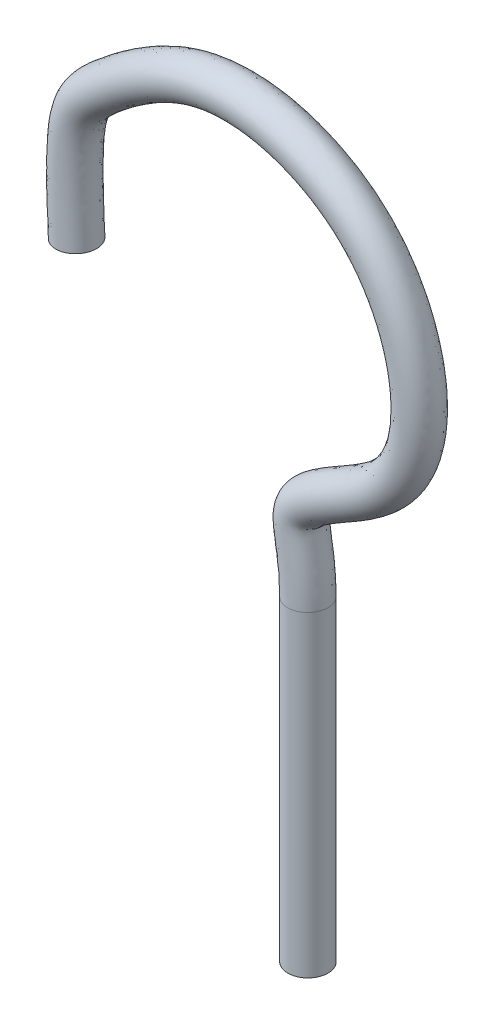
ISO-10303-21;
HEADER;
FILE_DESCRIPTION(('STEP AP214'),'2;1');
FILE_NAME('part.step','',(''),(''),'','','');
FILE_SCHEMA(('AUTOMOTIVE_DESIGN { 1 0 10303 214 1 1 1 1 }'));
ENDSEC;
DATA;
#1=APPLICATION_CONTEXT('core data for automotive mechanical design processes');
#2=APPLICATION_PROTOCOL_DEFINITION('international standard','automotive_design',2000,#1);
#3=PRODUCT_CONTEXT('',#1,'mechanical');
#4=PRODUCT('Part','Part','',(#3));
#5=PRODUCT_RELATED_PRODUCT_CATEGORY('part','',(#4));
#6=PRODUCT_DEFINITION_FORMATION('','',#4);
#7=PRODUCT_DEFINITION_CONTEXT('part definition',#1,'design');
#8=PRODUCT_DEFINITION('design','',#6,#7);
#9=PRODUCT_DEFINITION_SHAPE('','',#8);
#10=(LENGTH_UNIT() NAMED_UNIT(*) SI_UNIT(.MILLI.,.METRE.));
#11=(NAMED_UNIT(*) PLANE_ANGLE_UNIT() SI_UNIT($,.RADIAN.));
#12=(NAMED_UNIT(*) SI_UNIT($,.STERADIAN.) SOLID_ANGLE_UNIT());
#13=UNCERTAINTY_MEASURE_WITH_UNIT(LENGTH_MEASURE(1.E-05),#10,'distance_accuracy_value','');
#14=(GEOMETRIC_REPRESENTATION_CONTEXT(3) GLOBAL_UNCERTAINTY_ASSIGNED_CONTEXT((#13)) GLOBAL_UNIT_ASSIGNED_CONTEXT((#10,
#11,#12)) REPRESENTATION_CONTEXT('',''));
#15=CARTESIAN_POINT('',(0.,0.,0.));
#16=DIRECTION('',(0.,0.,1.));
#17=DIRECTION('',(1.,0.,0.));
#18=AXIS2_PLACEMENT_3D('',#15,#16,#17);
#19=CARTESIAN_POINT('',(0.,59.192237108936,0.));
#20=DIRECTION('',(0.,-1.,0.));
#21=DIRECTION('',(0.,0.,-1.));
#22=AXIS2_PLACEMENT_3D('',#19,#20,#21);
#23=CYLINDRICAL_SURFACE('',#22,3.175);
#24=CARTESIAN_POINT('',(0.,0.,0.));
#25=DIRECTION('',(0.,1.,0.));
#26=DIRECTION('',(0.,0.,1.));
#27=AXIS2_PLACEMENT_3D('',#24,#25,#26);
#28=CIRCLE('',#27,3.175);
#29=CARTESIAN_POINT('',(0.,0.,3.175));
#30=VERTEX_POINT('',#29);
#31=EDGE_CURVE('E36',#30,#30,#28,.T.);
#32=ORIENTED_EDGE('',*,*,#31,.T.);
#33=EDGE_LOOP('',(#32));
#34=FACE_BOUND('',#33,.T.);
#35=CARTESIAN_POINT('',(0.,50.2119809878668,0.));
#36=DIRECTION('',(-0.00847366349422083,0.999964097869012,0.));
#37=DIRECTION('',(-0.999964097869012,-0.00847366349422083,0.));
#38=AXIS2_PLACEMENT_3D('',#35,#36,#37);
#39=ELLIPSE('',#38,3.17511399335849,3.175);
#40=CARTESIAN_POINT('',(-3.175,50.1850761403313,0.));
#41=VERTEX_POINT('',#40);
#42=EDGE_CURVE('E10',#41,#41,#39,.T.);
#43=ORIENTED_EDGE('',*,*,#42,.F.);
#44=EDGE_LOOP('',(#43));
#45=FACE_BOUND('',#44,.T.);
#46=ADVANCED_FACE('F30',(#34,#45),#23,.T.);
#47=CARTESIAN_POINT('',(0.,0.,0.));
#48=DIRECTION('',(0.,1.,0.));
#49=DIRECTION('',(0.,0.,1.));
#50=AXIS2_PLACEMENT_3D('',#47,#48,#49);
#51=PLANE('',#50);
#52=ORIENTED_EDGE('',*,*,#31,.F.);
#53=EDGE_LOOP('',(#52));
#54=FACE_BOUND('',#53,.T.);
#55=ADVANCED_FACE('F51',(#54),#51,.F.);
#56=CARTESIAN_POINT('',(-39.877412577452,80.960911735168,0.));
#57=DIRECTION('',(-0.042817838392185,0.99908289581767,0.));
#58=DIRECTION('',(-0.99908289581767,-0.042817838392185,0.));
#59=AXIS2_PLACEMENT_3D('',#56,#57,#58);
#60=PLANE('',#59);
#61=CARTESIAN_POINT('',(-36.7053243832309,81.0968583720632,0.));
#62=DIRECTION('',(-0.0428178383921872,0.99908289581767,0.));
#63=DIRECTION('',(-0.99908289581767,-0.0428178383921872,0.));
#64=AXIS2_PLACEMENT_3D('',#61,#62,#63);
#65=CIRCLE('',#64,3.175);
#66=CARTESIAN_POINT('',(-39.877412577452,80.960911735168,0.));
#67=VERTEX_POINT('',#66);
#68=EDGE_CURVE('E40',#67,#67,#65,.T.);
#69=ORIENTED_EDGE('',*,*,#68,.F.);
#70=EDGE_LOOP('',(#69));
#71=FACE_BOUND('',#70,.T.);
#72=ADVANCED_FACE('F49',(#71),#60,.F.);
#73=CARTESIAN_POINT('',(-3.175,50.1850761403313,0.));
#74=CARTESIAN_POINT('',(-3.20229967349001,51.7957568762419,0.));
#75=CARTESIAN_POINT('',(-3.36604557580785,54.1860246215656,0.));
#76=CARTESIAN_POINT('',(-3.8522734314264,57.1630722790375,0.));
#77=CARTESIAN_POINT('',(-4.16279569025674,59.2565556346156,0.));
#78=CARTESIAN_POINT('',(-4.26476438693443,60.7847362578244,0.));
#79=CARTESIAN_POINT('',(-4.05722312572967,62.5607796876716,0.));
#80=CARTESIAN_POINT('',(-3.16658085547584,64.5408891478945,0.));
#81=CARTESIAN_POINT('',(-1.76440722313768,66.0497804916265,0.));
#82=CARTESIAN_POINT('',(-0.193154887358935,67.2680376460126,0.));
#83=CARTESIAN_POINT('',(2.40900807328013,68.9264801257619,0.));
#84=CARTESIAN_POINT('',(5.71371886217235,70.733372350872,0.));
#85=CARTESIAN_POINT('',(9.35596401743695,73.0748949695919,0.));
#86=CARTESIAN_POINT('',(11.9960999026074,75.6968502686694,0.));
#87=CARTESIAN_POINT('',(13.7601149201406,79.1175865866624,0.));
#88=CARTESIAN_POINT('',(14.5798968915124,83.1893012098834,0.));
#89=CARTESIAN_POINT('',(14.4649643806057,87.5771636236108,0.));
#90=CARTESIAN_POINT('',(13.4067611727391,92.4988409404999,0.));
#91=CARTESIAN_POINT('',(11.2516204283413,97.5730914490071,0.));
#92=CARTESIAN_POINT('',(7.88543030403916,102.223247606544,0.));
#93=CARTESIAN_POINT('',(3.64848366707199,105.856140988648,0.));
#94=CARTESIAN_POINT('',(-1.30240845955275,108.512170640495,0.));
#95=CARTESIAN_POINT('',(-6.70536320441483,110.130810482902,0.));
#96=CARTESIAN_POINT('',(-12.3541278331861,110.515226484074,0.));
#97=CARTESIAN_POINT('',(-17.914476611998,109.486161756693,0.));
#98=CARTESIAN_POINT('',(-22.6214209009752,107.199144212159,0.));
#99=CARTESIAN_POINT('',(-26.4620242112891,104.67689008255,0.));
#100=CARTESIAN_POINT('',(-29.2291829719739,102.513838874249,0.));
#101=CARTESIAN_POINT('',(-31.5215871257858,100.520802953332,0.));
#102=CARTESIAN_POINT('',(-32.5653368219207,99.2331157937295,0.));
#103=CARTESIAN_POINT('',(-33.0760074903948,98.121928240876,0.));
#104=CARTESIAN_POINT('',(-33.4180272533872,96.8790226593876,0.));
#105=CARTESIAN_POINT('',(-33.6640630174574,95.138062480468,0.));
#106=CARTESIAN_POINT('',(-33.9466008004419,90.0346229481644,0.));
#107=CARTESIAN_POINT('',(-33.7044362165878,85.2274723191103,0.));
#108=CARTESIAN_POINT('',(-33.5332361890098,81.2328050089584,0.));
#109=CARTESIAN_POINT('',(-3.175,50.1850761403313,6.34999999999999));
#110=CARTESIAN_POINT('',(-3.2083257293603,52.151294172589,6.34999999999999));
#111=CARTESIAN_POINT('',(-3.3640083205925,54.0658265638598,6.35));
#112=CARTESIAN_POINT('',(-3.8524357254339,57.17264762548,6.34999999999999));
#113=CARTESIAN_POINT('',(-4.16277337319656,59.2552389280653,6.35));
#114=CARTESIAN_POINT('',(-4.26476953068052,60.7850397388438,6.34999999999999));
#115=CARTESIAN_POINT('',(-4.05722180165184,62.5607015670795,6.34999999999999));
#116=CARTESIAN_POINT('',(-3.16658135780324,64.5409187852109,6.35));
#117=CARTESIAN_POINT('',(-1.76440704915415,66.0497702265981,6.35));
#118=CARTESIAN_POINT('',(-0.193154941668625,67.2680408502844,6.34999999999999));
#119=CARTESIAN_POINT('',(2.40900811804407,68.92647748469,6.35));
#120=CARTESIAN_POINT('',(5.71371884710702,70.7333732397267,6.34999999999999));
#121=CARTESIAN_POINT('',(9.35596402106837,73.0748947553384,6.34999999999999));
#122=CARTESIAN_POINT('',(11.996099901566,75.6968503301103,6.34999999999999));
#123=CARTESIAN_POINT('',(13.7601149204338,79.1175865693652,6.34999999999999));
#124=CARTESIAN_POINT('',(14.5798968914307,83.1893012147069,6.34999999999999));
#125=CARTESIAN_POINT('',(14.464964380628,87.5771636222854,6.35));
#126=CARTESIAN_POINT('',(13.4067611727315,92.4988409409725,6.34999999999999));
#127=CARTESIAN_POINT('',(11.2516204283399,97.5730914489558,6.35));
#128=CARTESIAN_POINT('',(7.88543030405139,102.223247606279,6.34999999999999));
#129=CARTESIAN_POINT('',(3.64848366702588,105.856140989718,6.35));
#130=CARTESIAN_POINT('',(-1.30240845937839,108.512170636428,6.34999999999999));
#131=CARTESIAN_POINT('',(-6.70536320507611,110.130810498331,6.34999999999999));
#132=CARTESIAN_POINT('',(-12.3541278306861,110.51522642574,6.34999999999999));
#133=CARTESIAN_POINT('',(-17.9144766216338,109.486161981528,6.34999999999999));
#134=CARTESIAN_POINT('',(-22.6214208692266,107.199143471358,6.35));
#135=CARTESIAN_POINT('',(-26.4620242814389,104.676891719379,6.34999999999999));
#136=CARTESIAN_POINT('',(-29.2291827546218,102.513833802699,6.35));
#137=CARTESIAN_POINT('',(-31.5215877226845,100.520816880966,6.35));
#138=CARTESIAN_POINT('',(-32.5653353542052,99.2330815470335,6.34999999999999));
#139=CARTESIAN_POINT('',(-33.0760105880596,98.1220005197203,6.35));
#140=CARTESIAN_POINT('',(-33.4180122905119,96.8786735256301,6.34999999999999));
#141=CARTESIAN_POINT('',(-33.6641390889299,95.1398374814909,6.34999999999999));
#142=CARTESIAN_POINT('',(-33.9456472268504,90.0123728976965,6.34999999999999));
#143=CARTESIAN_POINT('',(-33.7148699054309,85.4709250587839,6.34999999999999));
#144=CARTESIAN_POINT('',(-33.5332361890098,81.2328050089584,6.34999999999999));
#145=CARTESIAN_POINT('',(3.175,50.2388858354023,6.34999999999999));
#146=CARTESIAN_POINT('',(3.1416742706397,52.20510386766,6.34999999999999));
#147=CARTESIAN_POINT('',(2.95628712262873,54.8517315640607,6.35));
#148=CARTESIAN_POINT('',(2.39498514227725,58.3103866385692,6.34999999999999));
#149=CARTESIAN_POINT('',(2.14670933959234,60.0133096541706,6.35));
#150=CARTESIAN_POINT('',(2.12006660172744,60.7183182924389,6.34999999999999));
#151=CARTESIAN_POINT('',(2.17157502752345,60.8966335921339,6.34999999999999));
#152=CARTESIAN_POINT('',(2.13218938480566,60.8387799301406,6.35));
#153=CARTESIAN_POINT('',(2.45846467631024,61.2755236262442,6.35));
#154=CARTESIAN_POINT('',(3.41730241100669,62.0346407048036,6.34999999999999));
#155=CARTESIAN_POINT('',(5.50199149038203,63.3719681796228,6.35));
#156=CARTESIAN_POINT('',(8.86719175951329,65.2324637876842,6.34999999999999));
#157=CARTESIAN_POINT('',(13.1337976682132,67.9003023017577,6.34999999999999));
#158=CARTESIAN_POINT('',(17.2465881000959,71.9237867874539,6.34999999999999));
#159=CARTESIAN_POINT('',(19.8544375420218,77.0673093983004,6.34999999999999));
#160=CARTESIAN_POINT('',(20.9649217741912,82.7142399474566,6.34999999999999));
#161=CARTESIAN_POINT('',(20.7998647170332,88.3775781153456,6.35));
#162=CARTESIAN_POINT('',(19.4806463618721,94.4737741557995,6.34999999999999));
#163=CARTESIAN_POINT('',(16.8564661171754,100.66926473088,6.35));
#164=CARTESIAN_POINT('',(12.603802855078,106.56548782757,6.34999999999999));
#165=CARTESIAN_POINT('',(7.2317553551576,111.156900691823,6.35));
#166=CARTESIAN_POINT('',(1.14785494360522,114.41711276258,6.34999999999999));
#167=CARTESIAN_POINT('',(-5.53835888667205,116.42180926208,6.34999999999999));
#168=CARTESIAN_POINT('',(-12.6666265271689,116.933434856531,6.34999999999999));
#169=CARTESIAN_POINT('',(-20.0253228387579,115.556150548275,6.34999999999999));
#170=CARTESIAN_POINT('',(-25.7952234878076,112.714705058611,6.35));
#171=CARTESIAN_POINT('',(-30.164091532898,109.8506287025,6.34999999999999));
#172=CARTESIAN_POINT('',(-33.2958853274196,107.37619920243,6.35));
#173=CARTESIAN_POINT('',(-35.810237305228,105.259321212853,6.35));
#174=CARTESIAN_POINT('',(-37.9701170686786,102.708626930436,6.34999999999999));
#175=CARTESIAN_POINT('',(-39.1071133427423,100.208395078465,6.35));
#176=CARTESIAN_POINT('',(-39.6729517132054,98.0561948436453,6.34999999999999));
#177=CARTESIAN_POINT('',(-39.9969857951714,95.6874253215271,6.34999999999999));
#178=CARTESIAN_POINT('',(-40.314456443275,89.7179299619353,6.34999999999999));
#179=CARTESIAN_POINT('',(-40.0590462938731,85.1990317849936,6.34999999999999));
#180=CARTESIAN_POINT('',(-39.877412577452,80.960911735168,6.34999999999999));
#181=CARTESIAN_POINT('',(3.175,50.2388858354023,0.));
#182=CARTESIAN_POINT('',(3.14468729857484,52.0273352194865,0.));
#183=CARTESIAN_POINT('',(2.95526849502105,54.9118305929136,0.));
#184=CARTESIAN_POINT('',(2.395066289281,58.3055989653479,0.));
#185=CARTESIAN_POINT('',(2.14669818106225,60.0139680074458,0.));
#186=CARTESIAN_POINT('',(2.12006917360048,60.7181665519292,0.));
#187=CARTESIAN_POINT('',(2.17157436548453,60.8966726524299,0.));
#188=CARTESIAN_POINT('',(2.13218963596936,60.8387651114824,0.));
#189=CARTESIAN_POINT('',(2.45846458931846,61.2755287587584,0.));
#190=CARTESIAN_POINT('',(3.41730243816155,62.0346391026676,0.));
#191=CARTESIAN_POINT('',(5.50199146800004,63.3719695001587,0.));
#192=CARTESIAN_POINT('',(8.86719176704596,65.2324633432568,0.));
#193=CARTESIAN_POINT('',(13.1337976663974,67.9003024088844,0.));
#194=CARTESIAN_POINT('',(17.2465881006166,71.9237867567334,0.));
#195=CARTESIAN_POINT('',(19.8544375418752,77.067309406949,0.));
#196=CARTESIAN_POINT('',(20.9649217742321,82.7142399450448,0.));
#197=CARTESIAN_POINT('',(20.799864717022,88.3775781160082,0.));
#198=CARTESIAN_POINT('',(19.4806463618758,94.4737741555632,0.));
#199=CARTESIAN_POINT('',(16.8564661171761,100.669264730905,0.));
#200=CARTESIAN_POINT('',(12.6038028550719,106.565487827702,0.));
#201=CARTESIAN_POINT('',(7.23175535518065,111.156900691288,0.));
#202=CARTESIAN_POINT('',(1.14785494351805,114.417112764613,0.));
#203=CARTESIAN_POINT('',(-5.5383588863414,116.421809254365,0.));
#204=CARTESIAN_POINT('',(-12.6666265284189,116.933434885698,0.));
#205=CARTESIAN_POINT('',(-20.02532283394,115.556150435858,0.));
#206=CARTESIAN_POINT('',(-25.7952235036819,112.714705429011,0.));
#207=CARTESIAN_POINT('',(-30.164091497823,109.850627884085,0.));
#208=CARTESIAN_POINT('',(-33.2958854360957,107.376201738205,0.));
#209=CARTESIAN_POINT('',(-35.8102370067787,105.259314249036,0.));
#210=CARTESIAN_POINT('',(-37.9701178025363,102.708644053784,0.));
#211=CARTESIAN_POINT('',(-39.10711179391,100.208358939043,0.));
#212=CARTESIAN_POINT('',(-39.6729591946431,98.056369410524,0.));
#213=CARTESIAN_POINT('',(-39.9969477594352,95.6865378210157,0.));
#214=CARTESIAN_POINT('',(-40.3149332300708,89.7290549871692,0.));
#215=CARTESIAN_POINT('',(-40.0538294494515,85.0773054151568,0.));
#216=CARTESIAN_POINT('',(-39.877412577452,80.960911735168,0.));
#217=CARTESIAN_POINT('',(3.175,50.2388858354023,-6.34999999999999));
#218=CARTESIAN_POINT('',(3.14770032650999,51.8495665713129,-6.34999999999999));
#219=CARTESIAN_POINT('',(2.95424986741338,54.9719296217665,-6.35));
#220=CARTESIAN_POINT('',(2.39514743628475,58.3008112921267,-6.34999999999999));
#221=CARTESIAN_POINT('',(2.14668702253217,60.0146263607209,-6.35));
#222=CARTESIAN_POINT('',(2.12007174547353,60.7180148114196,-6.34999999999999));
#223=CARTESIAN_POINT('',(2.17157370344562,60.8967117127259,-6.34999999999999));
#224=CARTESIAN_POINT('',(2.13218988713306,60.8387502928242,-6.35));
#225=CARTESIAN_POINT('',(2.4584645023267,61.2755338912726,-6.35));
#226=CARTESIAN_POINT('',(3.41730246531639,62.0346375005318,-6.34999999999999));
#227=CARTESIAN_POINT('',(5.50199144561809,63.3719708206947,-6.35));
#228=CARTESIAN_POINT('',(8.86719177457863,65.2324628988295,-6.34999999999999));
#229=CARTESIAN_POINT('',(13.1337976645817,67.9003025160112,-6.34999999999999));
#230=CARTESIAN_POINT('',(17.2465881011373,71.9237867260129,-6.34999999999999));
#231=CARTESIAN_POINT('',(19.8544375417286,77.0673094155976,-6.34999999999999));
#232=CARTESIAN_POINT('',(20.964921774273,82.714239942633,-6.34999999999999));
#233=CARTESIAN_POINT('',(20.7998647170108,88.377578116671,-6.35));
#234=CARTESIAN_POINT('',(19.4806463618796,94.473774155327,-6.34999999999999));
#235=CARTESIAN_POINT('',(16.8564661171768,100.669264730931,-6.35));
#236=CARTESIAN_POINT('',(12.6038028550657,106.565487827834,-6.34999999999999));
#237=CARTESIAN_POINT('',(7.2317553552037,111.156900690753,-6.35));
#238=CARTESIAN_POINT('',(1.14785494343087,114.417112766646,-6.34999999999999));
#239=CARTESIAN_POINT('',(-5.53835888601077,116.42180924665,-6.34999999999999));
#240=CARTESIAN_POINT('',(-12.6666265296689,116.933434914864,-6.34999999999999));
#241=CARTESIAN_POINT('',(-20.0253228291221,115.55615032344,-6.34999999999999));
#242=CARTESIAN_POINT('',(-25.7952235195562,112.714705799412,-6.35));
#243=CARTESIAN_POINT('',(-30.1640914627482,109.85062706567,-6.34999999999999));
#244=CARTESIAN_POINT('',(-33.2958855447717,107.37620427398,-6.35));
#245=CARTESIAN_POINT('',(-35.8102367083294,105.259307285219,-6.35));
#246=CARTESIAN_POINT('',(-37.9701185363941,102.708661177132,-6.34999999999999));
#247=CARTESIAN_POINT('',(-39.1071102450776,100.20832279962,-6.35));
#248=CARTESIAN_POINT('',(-39.6729666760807,98.0565439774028,-6.34999999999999));
#249=CARTESIAN_POINT('',(-39.996909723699,95.6856503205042,-6.34999999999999));
#250=CARTESIAN_POINT('',(-40.3154100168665,89.7401800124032,-6.34999999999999));
#251=CARTESIAN_POINT('',(-40.04861260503,84.95557904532,-6.34999999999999));
#252=CARTESIAN_POINT('',(-39.877412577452,80.960911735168,-6.34999999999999));
#253=CARTESIAN_POINT('',(-3.175,50.1850761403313,-6.34999999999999));
#254=CARTESIAN_POINT('',(-3.19627361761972,51.4402195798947,-6.34999999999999));
#255=CARTESIAN_POINT('',(-3.36808283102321,54.3062226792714,-6.35));
#256=CARTESIAN_POINT('',(-3.8521111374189,57.1534969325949,-6.34999999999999));
#257=CARTESIAN_POINT('',(-4.16281800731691,59.2578723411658,-6.35));
#258=CARTESIAN_POINT('',(-4.26475924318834,60.7844327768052,-6.34999999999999));
#259=CARTESIAN_POINT('',(-4.0572244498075,62.5608578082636,-6.34999999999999));
#260=CARTESIAN_POINT('',(-3.16658035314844,64.5408595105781,-6.35));
#261=CARTESIAN_POINT('',(-1.76440739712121,66.049790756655,-6.35));
#262=CARTESIAN_POINT('',(-0.193154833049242,67.2680344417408,-6.34999999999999));
#263=CARTESIAN_POINT('',(2.40900802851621,68.9264827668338,-6.35));
#264=CARTESIAN_POINT('',(5.71371887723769,70.7333714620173,-6.34999999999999));
#265=CARTESIAN_POINT('',(9.35596401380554,73.0748951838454,-6.34999999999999));
#266=CARTESIAN_POINT('',(11.9960999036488,75.6968502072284,-6.34999999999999));
#267=CARTESIAN_POINT('',(13.7601149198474,79.1175866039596,-6.34999999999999));
#268=CARTESIAN_POINT('',(14.5798968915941,83.1893012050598,-6.34999999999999));
#269=CARTESIAN_POINT('',(14.4649643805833,87.5771636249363,-6.35));
#270=CARTESIAN_POINT('',(13.4067611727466,92.4988409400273,-6.34999999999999));
#271=CARTESIAN_POINT('',(11.2516204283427,97.5730914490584,-6.35));
#272=CARTESIAN_POINT('',(7.88543030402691,102.223247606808,-6.34999999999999));
#273=CARTESIAN_POINT('',(3.64848366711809,105.856140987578,-6.35));
#274=CARTESIAN_POINT('',(-1.30240845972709,108.512170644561,-6.34999999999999));
#275=CARTESIAN_POINT('',(-6.70536320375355,110.130810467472,-6.34999999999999));
#276=CARTESIAN_POINT('',(-12.3541278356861,110.515226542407,-6.34999999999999));
#277=CARTESIAN_POINT('',(-17.9144766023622,109.486161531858,-6.34999999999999));
#278=CARTESIAN_POINT('',(-22.6214209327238,107.19914495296,-6.35));
#279=CARTESIAN_POINT('',(-26.4620241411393,104.676888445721,-6.34999999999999));
#280=CARTESIAN_POINT('',(-29.2291831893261,102.513843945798,-6.35));
#281=CARTESIAN_POINT('',(-31.5215865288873,100.520789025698,-6.35));
#282=CARTESIAN_POINT('',(-32.5653382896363,99.2331500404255,-6.34999999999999));
#283=CARTESIAN_POINT('',(-33.0760043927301,98.1218559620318,-6.35));
#284=CARTESIAN_POINT('',(-33.4180422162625,96.879371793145,-6.34999999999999));
#285=CARTESIAN_POINT('',(-33.663986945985,95.136287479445,-6.34999999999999));
#286=CARTESIAN_POINT('',(-33.9475543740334,90.0568729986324,-6.34999999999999));
#287=CARTESIAN_POINT('',(-33.6940025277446,84.9840195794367,-6.34999999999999));
#288=CARTESIAN_POINT('',(-33.5332361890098,81.2328050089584,-6.34999999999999));
#289=CARTESIAN_POINT('',(-3.175,50.1850761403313,0.));
#290=CARTESIAN_POINT('',(-3.20229967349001,51.7957568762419,0.));
#291=CARTESIAN_POINT('',(-3.36604557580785,54.1860246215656,0.));
#292=CARTESIAN_POINT('',(-3.8522734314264,57.1630722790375,0.));
#293=CARTESIAN_POINT('',(-4.16279569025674,59.2565556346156,0.));
#294=CARTESIAN_POINT('',(-4.26476438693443,60.7847362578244,0.));
#295=CARTESIAN_POINT('',(-4.05722312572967,62.5607796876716,0.));
#296=CARTESIAN_POINT('',(-3.16658085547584,64.5408891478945,0.));
#297=CARTESIAN_POINT('',(-1.76440722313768,66.0497804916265,0.));
#298=CARTESIAN_POINT('',(-0.193154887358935,67.2680376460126,0.));
#299=CARTESIAN_POINT('',(2.40900807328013,68.9264801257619,0.));
#300=CARTESIAN_POINT('',(5.71371886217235,70.733372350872,0.));
#301=CARTESIAN_POINT('',(9.35596401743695,73.0748949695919,0.));
#302=CARTESIAN_POINT('',(11.9960999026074,75.6968502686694,0.));
#303=CARTESIAN_POINT('',(13.7601149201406,79.1175865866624,0.));
#304=CARTESIAN_POINT('',(14.5798968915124,83.1893012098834,0.));
#305=CARTESIAN_POINT('',(14.4649643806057,87.5771636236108,0.));
#306=CARTESIAN_POINT('',(13.4067611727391,92.4988409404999,0.));
#307=CARTESIAN_POINT('',(11.2516204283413,97.5730914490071,0.));
#308=CARTESIAN_POINT('',(7.88543030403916,102.223247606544,0.));
#309=CARTESIAN_POINT('',(3.64848366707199,105.856140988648,0.));
#310=CARTESIAN_POINT('',(-1.30240845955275,108.512170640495,0.));
#311=CARTESIAN_POINT('',(-6.70536320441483,110.130810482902,0.));
#312=CARTESIAN_POINT('',(-12.3541278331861,110.515226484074,0.));
#313=CARTESIAN_POINT('',(-17.914476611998,109.486161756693,0.));
#314=CARTESIAN_POINT('',(-22.6214209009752,107.199144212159,0.));
#315=CARTESIAN_POINT('',(-26.4620242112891,104.67689008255,0.));
#316=CARTESIAN_POINT('',(-29.2291829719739,102.513838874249,0.));
#317=CARTESIAN_POINT('',(-31.5215871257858,100.520802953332,0.));
#318=CARTESIAN_POINT('',(-32.5653368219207,99.2331157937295,0.));
#319=CARTESIAN_POINT('',(-33.0760074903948,98.121928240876,0.));
#320=CARTESIAN_POINT('',(-33.4180272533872,96.8790226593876,0.));
#321=CARTESIAN_POINT('',(-33.6640630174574,95.138062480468,0.));
#322=CARTESIAN_POINT('',(-33.9466008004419,90.0346229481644,0.));
#323=CARTESIAN_POINT('',(-33.7044362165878,85.2274723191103,0.));
#324=CARTESIAN_POINT('',(-33.5332361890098,81.2328050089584,0.));
#325=(BOUNDED_SURFACE() B_SPLINE_SURFACE(3,3,((#73,#74,#75,#76,#77,#78,#79,#80,#81,#82,#83,#84,
#85,#86,#87,#88,#89,#90,#91,#92,#93,#94,#95,#96,#97,#98,#99,#100,#101,#102,#103,#104,#105,#106,
#107,#108),(#109,#110,#111,#112,#113,#114,#115,#116,#117,#118,#119,#120,#121,#122,#123,#124,
#125,#126,#127,#128,#129,#130,#131,#132,#133,#134,#135,#136,#137,#138,#139,#140,#141,#142,#143,
#144),(#145,#146,#147,#148,#149,#150,#151,#152,#153,#154,#155,#156,#157,#158,#159,#160,#161,
#162,#163,#164,#165,#166,#167,#168,#169,#170,#171,#172,#173,#174,#175,#176,#177,#178,#179,#180),
(#181,#182,#183,#184,#185,#186,#187,#188,#189,#190,#191,#192,#193,#194,#195,#196,#197,#198,#199,
#200,#201,#202,#203,#204,#205,#206,#207,#208,#209,#210,#211,#212,#213,#214,#215,#216),(#217,
#218,#219,#220,#221,#222,#223,#224,#225,#226,#227,#228,#229,#230,#231,#232,#233,#234,#235,#236,
#237,#238,#239,#240,#241,#242,#243,#244,#245,#246,#247,#248,#249,#250,#251,#252),(#253,#254,
#255,#256,#257,#258,#259,#260,#261,#262,#263,#264,#265,#266,#267,#268,#269,#270,#271,#272,#273,
#274,#275,#276,#277,#278,#279,#280,#281,#282,#283,#284,#285,#286,#287,#288),(#289,#290,#291,
#292,#293,#294,#295,#296,#297,#298,#299,#300,#301,#302,#303,#304,#305,#306,#307,#308,#309,#310,
#311,#312,#313,#314,#315,#316,#317,#318,#319,#320,#321,#322,#323,#324)),.UNSPECIFIED.,.T.,.F.,
.F.) B_SPLINE_SURFACE_WITH_KNOTS((4,3,4),(4,1,1,1,1,1,1,1,1,1,1,1,1,1,1,1,1,1,1,1,1,1,1,1,1,1,1,
1,1,1,1,1,1,4),(0.,0.5,1.),(0.,0.0355491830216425,0.0607717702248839,0.0705531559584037,
0.0790769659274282,0.086948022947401,0.0948545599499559,0.105683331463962,0.117995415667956,
0.13182628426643,0.168621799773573,0.202772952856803,0.234831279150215,0.269757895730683,
0.305168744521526,0.341732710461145,0.379080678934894,0.428390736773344,0.475189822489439,
0.520446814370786,0.565856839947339,0.611821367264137,0.658052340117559,0.70503674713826,
0.753637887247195,0.785130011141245,0.813462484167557,0.836469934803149,0.855249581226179,
0.865886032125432,0.878054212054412,0.892819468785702,0.91108729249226,1.),
.UNSPECIFIED.) GEOMETRIC_REPRESENTATION_ITEM() RATIONAL_B_SPLINE_SURFACE(((1.,1.,1.,1.,1.,1.,1.,
1.,1.,1.,0.999999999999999,1.,1.,1.,1.,1.,1.,1.,1.,1.,1.,1.,1.,1.,1.,1.,1.,1.,1.,1.,1.,1.,1.,1.,
1.,1.),(0.333333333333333,0.333333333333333,0.333333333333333,0.333333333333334,
0.333333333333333,0.333333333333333,0.333333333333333,0.333333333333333,0.333333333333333,
0.333333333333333,0.333333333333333,0.333333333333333,0.333333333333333,0.333333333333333,
0.333333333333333,0.333333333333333,0.333333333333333,0.333333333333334,0.333333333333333,
0.333333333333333,0.333333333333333,0.333333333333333,0.333333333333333,0.333333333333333,
0.333333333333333,0.333333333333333,0.333333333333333,0.333333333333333,0.333333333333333,
0.333333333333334,0.333333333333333,0.333333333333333,0.333333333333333,0.333333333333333,
0.333333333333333,0.333333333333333),(0.333333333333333,0.333333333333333,0.333333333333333,
0.333333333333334,0.333333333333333,0.333333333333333,0.333333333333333,0.333333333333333,
0.333333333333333,0.333333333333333,0.333333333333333,0.333333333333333,0.333333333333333,
0.333333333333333,0.333333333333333,0.333333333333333,0.333333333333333,0.333333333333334,
0.333333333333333,0.333333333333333,0.333333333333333,0.333333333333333,0.333333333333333,
0.333333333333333,0.333333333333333,0.333333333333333,0.333333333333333,0.333333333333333,
0.333333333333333,0.333333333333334,0.333333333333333,0.333333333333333,0.333333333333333,
0.333333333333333,0.333333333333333,0.333333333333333),(1.,1.,1.,1.,1.,1.,1.,1.,1.,1.,
0.999999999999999,1.,1.,1.,1.,1.,1.,1.,1.,1.,1.,1.,1.,1.,1.,1.,1.,1.,1.,1.,1.,1.,1.,1.,1.,1.),
(0.333333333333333,0.333333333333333,0.333333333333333,0.333333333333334,0.333333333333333,
0.333333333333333,0.333333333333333,0.333333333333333,0.333333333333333,0.333333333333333,
0.333333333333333,0.333333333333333,0.333333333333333,0.333333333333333,0.333333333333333,
0.333333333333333,0.333333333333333,0.333333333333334,0.333333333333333,0.333333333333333,
0.333333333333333,0.333333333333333,0.333333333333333,0.333333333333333,0.333333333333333,
0.333333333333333,0.333333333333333,0.333333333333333,0.333333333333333,0.333333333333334,
0.333333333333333,0.333333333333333,0.333333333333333,0.333333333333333,0.333333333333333,
0.333333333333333),(0.333333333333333,0.333333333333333,0.333333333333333,0.333333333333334,
0.333333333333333,0.333333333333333,0.333333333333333,0.333333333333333,0.333333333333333,
0.333333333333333,0.333333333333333,0.333333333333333,0.333333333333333,0.333333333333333,
0.333333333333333,0.333333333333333,0.333333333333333,0.333333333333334,0.333333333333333,
0.333333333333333,0.333333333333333,0.333333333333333,0.333333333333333,0.333333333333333,
0.333333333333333,0.333333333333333,0.333333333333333,0.333333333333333,0.333333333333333,
0.333333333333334,0.333333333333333,0.333333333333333,0.333333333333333,0.333333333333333,
0.333333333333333,0.333333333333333),(1.,1.,1.,1.,1.,1.,1.,1.,1.,1.,0.999999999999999,1.,1.,1.,
1.,1.,1.,1.,1.,1.,1.,1.,1.,1.,1.,1.,1.,1.,1.,1.,1.,1.,1.,1.,1.,1.))) REPRESENTATION_ITEM('') SURFACE());
#326=ORIENTED_EDGE('',*,*,#42,.T.);
#327=EDGE_LOOP('',(#326));
#328=FACE_BOUND('',#327,.T.);
#329=ORIENTED_EDGE('',*,*,#68,.T.);
#330=EDGE_LOOP('',(#329));
#331=FACE_BOUND('',#330,.T.);
#332=ADVANCED_FACE('F47',(#328,#331),#325,.T.);
#333=CLOSED_SHELL('',(#46,#55,#72,#332));
#334=MANIFOLD_SOLID_BREP('B2',#333);
#335=ADVANCED_BREP_SHAPE_REPRESENTATION('',(#18,#334),#14);
#336=SHAPE_DEFINITION_REPRESENTATION(#9,#335);
ENDSEC;
END-ISO-10303-21;
